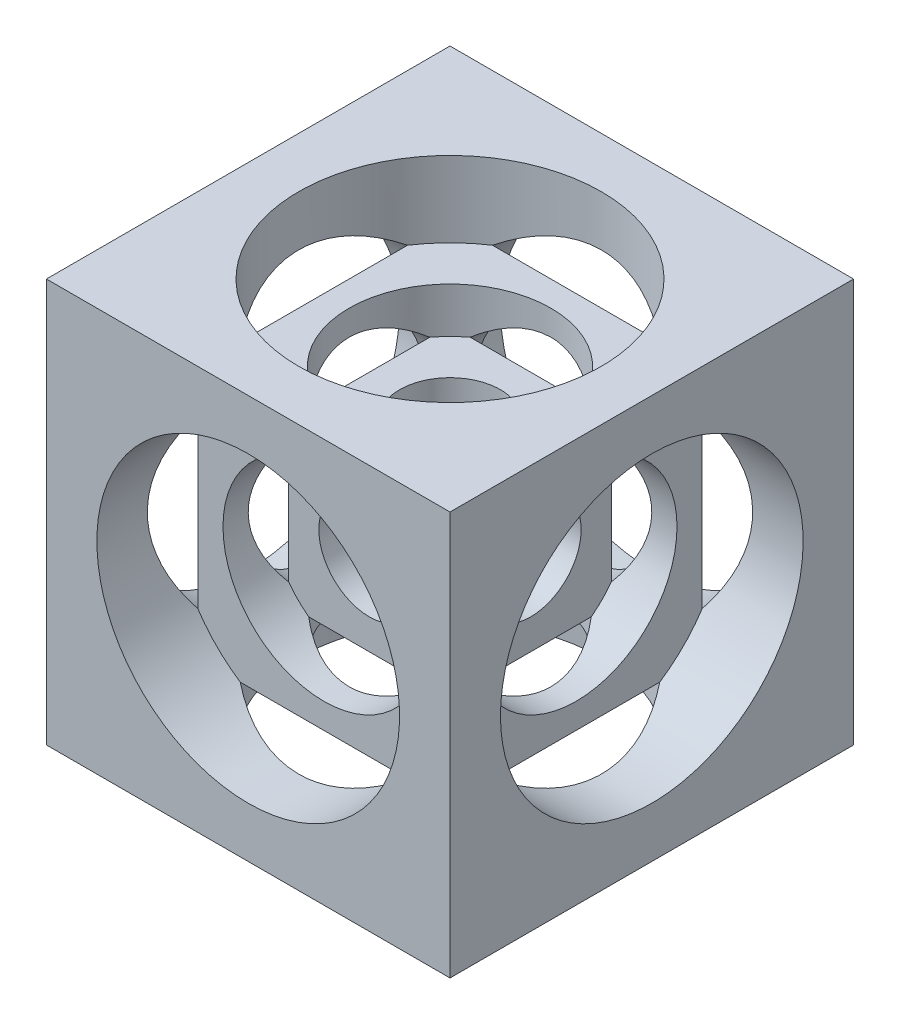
ISO-10303-21;
HEADER;
FILE_DESCRIPTION(('STEP AP214'),'2;1');
FILE_NAME('part.step','',(''),(''),'','','');
FILE_SCHEMA(('AUTOMOTIVE_DESIGN { 1 0 10303 214 1 1 1 1 }'));
ENDSEC;
DATA;
#1=APPLICATION_CONTEXT('core data for automotive mechanical design processes');
#2=APPLICATION_PROTOCOL_DEFINITION('international standard','automotive_design',2000,#1);
#3=PRODUCT_CONTEXT('',#1,'mechanical');
#4=PRODUCT('Part','Part','',(#3));
#5=PRODUCT_RELATED_PRODUCT_CATEGORY('part','',(#4));
#6=PRODUCT_DEFINITION_FORMATION('','',#4);
#7=PRODUCT_DEFINITION_CONTEXT('part definition',#1,'design');
#8=PRODUCT_DEFINITION('design','',#6,#7);
#9=PRODUCT_DEFINITION_SHAPE('','',#8);
#10=(LENGTH_UNIT() NAMED_UNIT(*) SI_UNIT(.MILLI.,.METRE.));
#11=(NAMED_UNIT(*) PLANE_ANGLE_UNIT() SI_UNIT($,.RADIAN.));
#12=(NAMED_UNIT(*) SI_UNIT($,.STERADIAN.) SOLID_ANGLE_UNIT());
#13=UNCERTAINTY_MEASURE_WITH_UNIT(LENGTH_MEASURE(1.E-05),#10,'distance_accuracy_value','');
#14=(GEOMETRIC_REPRESENTATION_CONTEXT(3) GLOBAL_UNCERTAINTY_ASSIGNED_CONTEXT((#13)) GLOBAL_UNIT_ASSIGNED_CONTEXT((#10,
#11,#12)) REPRESENTATION_CONTEXT('',''));
#15=CARTESIAN_POINT('',(0.,0.,0.));
#16=DIRECTION('',(0.,0.,1.));
#17=DIRECTION('',(1.,0.,0.));
#18=AXIS2_PLACEMENT_3D('',#15,#16,#17);
#19=CARTESIAN_POINT('',(12.7,20.6375,-12.7));
#20=DIRECTION('',(0.,1.,0.));
#21=DIRECTION('',(0.,0.,1.));
#22=AXIS2_PLACEMENT_3D('',#19,#20,#21);
#23=PLANE('',#22);
#24=CARTESIAN_POINT('',(12.7,20.6375,-12.7));
#25=DIRECTION('',(0.,1.,0.));
#26=DIRECTION('',(0.,0.,1.));
#27=AXIS2_PLACEMENT_3D('',#24,#25,#26);
#28=CIRCLE('',#27,6.35);
#29=CARTESIAN_POINT('',(12.7,20.6375,-6.35));
#30=VERTEX_POINT('',#29);
#31=EDGE_CURVE('E457',#30,#30,#28,.F.);
#32=ORIENTED_EDGE('',*,*,#31,.T.);
#33=EDGE_LOOP('',(#32));
#34=FACE_BOUND('',#33,.T.);
#35=CARTESIAN_POINT('',(12.7,20.6375,-12.7));
#36=DIRECTION('',(0.,1.,0.));
#37=DIRECTION('',(0.,0.,1.));
#38=AXIS2_PLACEMENT_3D('',#35,#36,#37);
#39=CIRCLE('',#38,9.525);
#40=CARTESIAN_POINT('',(20.6374999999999,20.6375,-17.9651418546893));
#41=VERTEX_POINT('',#40);
#42=CARTESIAN_POINT('',(17.9651418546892,20.6375,-20.6375));
#43=VERTEX_POINT('',#42);
#44=EDGE_CURVE('E377',#41,#43,#39,.T.);
#45=ORIENTED_EDGE('',*,*,#44,.T.);
#46=DIRECTION('',(-1.,0.,0.));
#47=VECTOR('',#46,1.);
#48=CARTESIAN_POINT('',(12.7,20.6375,-20.6375));
#49=LINE('',#48,#47);
#50=CARTESIAN_POINT('',(7.43485814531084,20.6375,-20.6375));
#51=VERTEX_POINT('',#50);
#52=EDGE_CURVE('E248',#43,#51,#49,.T.);
#53=ORIENTED_EDGE('',*,*,#52,.T.);
#54=CARTESIAN_POINT('',(4.76249999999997,20.6375,-17.9651418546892));
#55=VERTEX_POINT('',#54);
#56=EDGE_CURVE('E375',#51,#55,#39,.T.);
#57=ORIENTED_EDGE('',*,*,#56,.T.);
#58=DIRECTION('',(0.,0.,1.));
#59=VECTOR('',#58,1.);
#60=CARTESIAN_POINT('',(4.76249999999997,20.6375,-12.7));
#61=LINE('',#60,#59);
#62=CARTESIAN_POINT('',(4.76249999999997,20.6375,-7.43485814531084));
#63=VERTEX_POINT('',#62);
#64=EDGE_CURVE('E326',#55,#63,#61,.T.);
#65=ORIENTED_EDGE('',*,*,#64,.T.);
#66=CARTESIAN_POINT('',(7.43485814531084,20.6375,-4.76249999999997));
#67=VERTEX_POINT('',#66);
#68=EDGE_CURVE('E372',#63,#67,#39,.T.);
#69=ORIENTED_EDGE('',*,*,#68,.T.);
#70=DIRECTION('',(1.,0.,0.));
#71=VECTOR('',#70,1.);
#72=CARTESIAN_POINT('',(12.7,20.6375,-4.76249999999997));
#73=LINE('',#72,#71);
#74=CARTESIAN_POINT('',(17.9651418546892,20.6375,-4.7625));
#75=VERTEX_POINT('',#74);
#76=EDGE_CURVE('E549',#67,#75,#73,.T.);
#77=ORIENTED_EDGE('',*,*,#76,.T.);
#78=CARTESIAN_POINT('',(20.6374999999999,20.6375,-7.43485814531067));
#79=VERTEX_POINT('',#78);
#80=EDGE_CURVE('E376',#75,#79,#39,.T.);
#81=ORIENTED_EDGE('',*,*,#80,.T.);
#82=DIRECTION('',(0.,0.,-1.));
#83=VECTOR('',#82,1.);
#84=CARTESIAN_POINT('',(20.6374999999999,20.6375,-12.7));
#85=LINE('',#84,#83);
#86=EDGE_CURVE('E322',#79,#41,#85,.T.);
#87=ORIENTED_EDGE('',*,*,#86,.T.);
#88=EDGE_LOOP('',(#45,#53,#57,#65,#69,#77,#81,#87));
#89=FACE_BOUND('',#88,.T.);
#90=ADVANCED_FACE('F32',(#34,#89),#23,.T.);
#91=CARTESIAN_POINT('',(4.7625,12.7,-12.7));
#92=DIRECTION('',(-1.,0.,0.));
#93=DIRECTION('',(0.,0.,1.));
#94=AXIS2_PLACEMENT_3D('',#91,#92,#93);
#95=PLANE('',#94);
#96=CARTESIAN_POINT('',(4.7625,12.7,-12.7));
#97=DIRECTION('',(-1.,0.,0.));
#98=DIRECTION('',(0.,-1.,0.));
#99=AXIS2_PLACEMENT_3D('',#96,#97,#98);
#100=CIRCLE('',#99,6.35);
#101=CARTESIAN_POINT('',(4.76250000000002,6.34999999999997,-12.7));
#102=VERTEX_POINT('',#101);
#103=EDGE_CURVE('E324',#102,#102,#100,.F.);
#104=ORIENTED_EDGE('',*,*,#103,.T.);
#105=EDGE_LOOP('',(#104));
#106=FACE_BOUND('',#105,.T.);
#107=CARTESIAN_POINT('',(4.7625,12.7,-12.7));
#108=DIRECTION('',(-1.,0.,0.));
#109=DIRECTION('',(0.,0.,1.));
#110=AXIS2_PLACEMENT_3D('',#107,#108,#109);
#111=CIRCLE('',#110,9.525);
#112=CARTESIAN_POINT('',(4.76249999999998,17.9651418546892,-20.6375));
#113=VERTEX_POINT('',#112);
#114=EDGE_CURVE('E316',#55,#113,#111,.T.);
#115=ORIENTED_EDGE('',*,*,#114,.T.);
#116=DIRECTION('',(0.,-1.,0.));
#117=VECTOR('',#116,1.);
#118=CARTESIAN_POINT('',(4.7625,12.6999999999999,-20.6375));
#119=LINE('',#118,#117);
#120=CARTESIAN_POINT('',(4.76250000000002,7.43485814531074,-20.6375));
#121=VERTEX_POINT('',#120);
#122=EDGE_CURVE('E266',#113,#121,#119,.T.);
#123=ORIENTED_EDGE('',*,*,#122,.T.);
#124=CARTESIAN_POINT('',(4.7625,4.7625,-17.9651418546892));
#125=VERTEX_POINT('',#124);
#126=EDGE_CURVE('E315',#121,#125,#111,.T.);
#127=ORIENTED_EDGE('',*,*,#126,.T.);
#128=DIRECTION('',(0.,0.,1.));
#129=VECTOR('',#128,1.);
#130=CARTESIAN_POINT('',(4.76250000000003,4.7625,-12.7));
#131=LINE('',#130,#129);
#132=CARTESIAN_POINT('',(4.76250000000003,4.7625,-7.43485814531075));
#133=VERTEX_POINT('',#132);
#134=EDGE_CURVE('E313',#125,#133,#131,.T.);
#135=ORIENTED_EDGE('',*,*,#134,.T.);
#136=CARTESIAN_POINT('',(4.76250000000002,7.43485814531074,-4.76250000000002));
#137=VERTEX_POINT('',#136);
#138=EDGE_CURVE('E310',#133,#137,#111,.T.);
#139=ORIENTED_EDGE('',*,*,#138,.T.);
#140=DIRECTION('',(0.,1.,0.));
#141=VECTOR('',#140,1.);
#142=CARTESIAN_POINT('',(4.7625,12.6999999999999,-4.7625));
#143=LINE('',#142,#141);
#144=CARTESIAN_POINT('',(4.76249999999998,17.9651418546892,-4.76249999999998));
#145=VERTEX_POINT('',#144);
#146=EDGE_CURVE('E546',#137,#145,#143,.T.);
#147=ORIENTED_EDGE('',*,*,#146,.T.);
#148=EDGE_CURVE('E314',#145,#63,#111,.T.);
#149=ORIENTED_EDGE('',*,*,#148,.T.);
#150=ORIENTED_EDGE('',*,*,#64,.F.);
#151=EDGE_LOOP('',(#115,#123,#127,#135,#139,#147,#149,#150));
#152=FACE_BOUND('',#151,.T.);
#153=ADVANCED_FACE('F683',(#106,#152),#95,.T.);
#154=CARTESIAN_POINT('',(20.6375,12.7000000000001,-12.7));
#155=DIRECTION('',(1.,0.,0.));
#156=DIRECTION('',(0.,0.,1.));
#157=AXIS2_PLACEMENT_3D('',#154,#155,#156);
#158=PLANE('',#157);
#159=CARTESIAN_POINT('',(20.6375,12.7000000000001,-12.7));
#160=DIRECTION('',(1.,0.,0.));
#161=DIRECTION('',(0.,1.,0.));
#162=AXIS2_PLACEMENT_3D('',#159,#160,#161);
#163=CIRCLE('',#162,6.35);
#164=CARTESIAN_POINT('',(20.6374999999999,19.0500000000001,-12.7));
#165=VERTEX_POINT('',#164);
#166=EDGE_CURVE('E325',#165,#165,#163,.F.);
#167=ORIENTED_EDGE('',*,*,#166,.T.);
#168=EDGE_LOOP('',(#167));
#169=FACE_BOUND('',#168,.T.);
#170=CARTESIAN_POINT('',(20.6375,12.7000000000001,-12.7));
#171=DIRECTION('',(1.,0.,0.));
#172=DIRECTION('',(0.,0.,1.));
#173=AXIS2_PLACEMENT_3D('',#170,#171,#172);
#174=CIRCLE('',#173,9.525);
#175=CARTESIAN_POINT('',(20.6375000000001,4.7625,-17.9651418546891));
#176=VERTEX_POINT('',#175);
#177=CARTESIAN_POINT('',(20.6375000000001,7.43485814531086,-20.6375));
#178=VERTEX_POINT('',#177);
#179=EDGE_CURVE('E265',#176,#178,#174,.T.);
#180=ORIENTED_EDGE('',*,*,#179,.T.);
#181=DIRECTION('',(0.,1.,0.));
#182=VECTOR('',#181,1.);
#183=CARTESIAN_POINT('',(20.6375,12.7000000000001,-20.6375));
#184=LINE('',#183,#182);
#185=CARTESIAN_POINT('',(20.6374999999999,17.9651418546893,-20.6375));
#186=VERTEX_POINT('',#185);
#187=EDGE_CURVE('E254',#178,#186,#184,.T.);
#188=ORIENTED_EDGE('',*,*,#187,.T.);
#189=EDGE_CURVE('E262',#186,#41,#174,.T.);
#190=ORIENTED_EDGE('',*,*,#189,.T.);
#191=ORIENTED_EDGE('',*,*,#86,.F.);
#192=CARTESIAN_POINT('',(20.6374999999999,17.9651418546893,-4.76249999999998));
#193=VERTEX_POINT('',#192);
#194=EDGE_CURVE('E274',#79,#193,#174,.T.);
#195=ORIENTED_EDGE('',*,*,#194,.T.);
#196=DIRECTION('',(0.,-1.,0.));
#197=VECTOR('',#196,1.);
#198=CARTESIAN_POINT('',(20.6375,12.7000000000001,-4.7625));
#199=LINE('',#198,#197);
#200=CARTESIAN_POINT('',(20.6375000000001,7.43485814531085,-4.76250000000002));
#201=VERTEX_POINT('',#200);
#202=EDGE_CURVE('E544',#193,#201,#199,.T.);
#203=ORIENTED_EDGE('',*,*,#202,.T.);
#204=CARTESIAN_POINT('',(20.6375000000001,4.7625,-7.43485814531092));
#205=VERTEX_POINT('',#204);
#206=EDGE_CURVE('E276',#201,#205,#174,.T.);
#207=ORIENTED_EDGE('',*,*,#206,.T.);
#208=DIRECTION('',(0.,0.,1.));
#209=VECTOR('',#208,1.);
#210=CARTESIAN_POINT('',(20.6375000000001,4.7625,-12.7));
#211=LINE('',#210,#209);
#212=EDGE_CURVE('E298',#176,#205,#211,.T.);
#213=ORIENTED_EDGE('',*,*,#212,.F.);
#214=EDGE_LOOP('',(#180,#188,#190,#191,#195,#203,#207,#213));
#215=FACE_BOUND('',#214,.T.);
#216=ADVANCED_FACE('F260',(#169,#215),#158,.T.);
#217=CARTESIAN_POINT('',(12.7,4.7625,-12.7));
#218=DIRECTION('',(0.,-1.,0.));
#219=DIRECTION('',(0.,0.,1.));
#220=AXIS2_PLACEMENT_3D('',#217,#218,#219);
#221=PLANE('',#220);
#222=CARTESIAN_POINT('',(12.7,4.7625,-12.7));
#223=DIRECTION('',(0.,-1.,0.));
#224=DIRECTION('',(0.,0.,-1.));
#225=AXIS2_PLACEMENT_3D('',#222,#223,#224);
#226=CIRCLE('',#225,6.35);
#227=CARTESIAN_POINT('',(12.7,4.7625,-19.05));
#228=VERTEX_POINT('',#227);
#229=EDGE_CURVE('E321',#228,#228,#226,.F.);
#230=ORIENTED_EDGE('',*,*,#229,.T.);
#231=EDGE_LOOP('',(#230));
#232=FACE_BOUND('',#231,.T.);
#233=CARTESIAN_POINT('',(12.7,4.7625,-12.7));
#234=DIRECTION('',(0.,-1.,0.));
#235=DIRECTION('',(0.,0.,1.));
#236=AXIS2_PLACEMENT_3D('',#233,#234,#235);
#237=CIRCLE('',#236,9.525);
#238=CARTESIAN_POINT('',(7.43485814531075,4.7625,-20.6375));
#239=VERTEX_POINT('',#238);
#240=EDGE_CURVE('E301',#125,#239,#237,.T.);
#241=ORIENTED_EDGE('',*,*,#240,.T.);
#242=DIRECTION('',(1.,0.,0.));
#243=VECTOR('',#242,1.);
#244=CARTESIAN_POINT('',(12.7,4.7625,-20.6375));
#245=LINE('',#244,#243);
#246=CARTESIAN_POINT('',(17.9651418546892,4.7625,-20.6375));
#247=VERTEX_POINT('',#246);
#248=EDGE_CURVE('E267',#239,#247,#245,.T.);
#249=ORIENTED_EDGE('',*,*,#248,.T.);
#250=EDGE_CURVE('E300',#247,#176,#237,.T.);
#251=ORIENTED_EDGE('',*,*,#250,.T.);
#252=ORIENTED_EDGE('',*,*,#212,.T.);
#253=CARTESIAN_POINT('',(17.9651418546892,4.7625,-4.76250000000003));
#254=VERTEX_POINT('',#253);
#255=EDGE_CURVE('E295',#205,#254,#237,.T.);
#256=ORIENTED_EDGE('',*,*,#255,.T.);
#257=DIRECTION('',(-1.,0.,0.));
#258=VECTOR('',#257,1.);
#259=CARTESIAN_POINT('',(12.7,4.7625,-4.76250000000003));
#260=LINE('',#259,#258);
#261=CARTESIAN_POINT('',(7.43485814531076,4.7625,-4.7625));
#262=VERTEX_POINT('',#261);
#263=EDGE_CURVE('E483',#254,#262,#260,.T.);
#264=ORIENTED_EDGE('',*,*,#263,.T.);
#265=EDGE_CURVE('E299',#262,#133,#237,.T.);
#266=ORIENTED_EDGE('',*,*,#265,.T.);
#267=ORIENTED_EDGE('',*,*,#134,.F.);
#268=EDGE_LOOP('',(#241,#249,#251,#252,#256,#264,#266,#267));
#269=FACE_BOUND('',#268,.T.);
#270=ADVANCED_FACE('F738',(#232,#269),#221,.T.);
#271=CARTESIAN_POINT('',(12.7,12.7,-17.78));
#272=DIRECTION('',(0.,0.,-1.));
#273=DIRECTION('',(0.,1.,0.));
#274=AXIS2_PLACEMENT_3D('',#271,#272,#273);
#275=CYLINDRICAL_SURFACE('',#274,6.35);
#276=CARTESIAN_POINT('',(12.7,12.7,-17.78));
#277=DIRECTION('',(0.,0.,-1.));
#278=DIRECTION('',(0.,1.,0.));
#279=AXIS2_PLACEMENT_3D('',#276,#277,#278);
#280=CIRCLE('',#279,6.35);
#281=CARTESIAN_POINT('',(8.88999999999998,7.62,-17.78));
#282=VERTEX_POINT('',#281);
#283=CARTESIAN_POINT('',(7.62000000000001,8.88999999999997,-17.78));
#284=VERTEX_POINT('',#283);
#285=EDGE_CURVE('E657',#282,#284,#280,.T.);
#286=ORIENTED_EDGE('',*,*,#285,.F.);
#287=CARTESIAN_POINT('',(12.7,12.7,-12.7));
#288=DIRECTION('',(0.,-0.707106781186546,0.707106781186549));
#289=DIRECTION('',(0.,-0.707106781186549,-0.707106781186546));
#290=AXIS2_PLACEMENT_3D('',#287,#288,#289);
#291=ELLIPSE('',#290,8.98025612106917,6.35);
#292=CARTESIAN_POINT('',(16.51,7.62,-17.78));
#293=VERTEX_POINT('',#292);
#294=EDGE_CURVE('E527',#293,#282,#291,.F.);
#295=ORIENTED_EDGE('',*,*,#294,.F.);
#296=CARTESIAN_POINT('',(17.78,8.89000000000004,-17.78));
#297=VERTEX_POINT('',#296);
#298=EDGE_CURVE('E512',#297,#293,#280,.T.);
#299=ORIENTED_EDGE('',*,*,#298,.F.);
#300=CARTESIAN_POINT('',(12.7,12.7,-12.7));
#301=DIRECTION('',(0.707106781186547,0.,0.707106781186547));
#302=DIRECTION('',(0.707106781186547,0.,-0.707106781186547));
#303=AXIS2_PLACEMENT_3D('',#300,#301,#302);
#304=ELLIPSE('',#303,8.98025612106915,6.35);
#305=CARTESIAN_POINT('',(17.78,16.51,-17.78));
#306=VERTEX_POINT('',#305);
#307=EDGE_CURVE('E530',#306,#297,#304,.F.);
#308=ORIENTED_EDGE('',*,*,#307,.F.);
#309=CARTESIAN_POINT('',(16.51,17.78,-17.78));
#310=VERTEX_POINT('',#309);
#311=EDGE_CURVE('E490',#310,#306,#280,.T.);
#312=ORIENTED_EDGE('',*,*,#311,.F.);
#313=CARTESIAN_POINT('',(12.7,12.7,-12.7));
#314=DIRECTION('',(0.,0.707106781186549,0.707106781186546));
#315=DIRECTION('',(0.,0.707106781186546,-0.707106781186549));
#316=AXIS2_PLACEMENT_3D('',#313,#314,#315);
#317=ELLIPSE('',#316,8.98025612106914,6.35);
#318=CARTESIAN_POINT('',(8.89000000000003,17.78,-17.78));
#319=VERTEX_POINT('',#318);
#320=EDGE_CURVE('E524',#319,#310,#317,.F.);
#321=ORIENTED_EDGE('',*,*,#320,.F.);
#322=CARTESIAN_POINT('',(7.61999999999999,16.51,-17.78));
#323=VERTEX_POINT('',#322);
#324=EDGE_CURVE('E509',#323,#319,#280,.T.);
#325=ORIENTED_EDGE('',*,*,#324,.F.);
#326=CARTESIAN_POINT('',(12.7,12.7,-12.7));
#327=DIRECTION('',(-0.707106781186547,0.,0.707106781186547));
#328=DIRECTION('',(-0.707106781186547,0.,-0.707106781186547));
#329=AXIS2_PLACEMENT_3D('',#326,#327,#328);
#330=ELLIPSE('',#329,8.98025612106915,6.35);
#331=EDGE_CURVE('E533',#284,#323,#330,.F.);
#332=ORIENTED_EDGE('',*,*,#331,.F.);
#333=EDGE_LOOP('',(#286,#295,#299,#308,#312,#321,#325,#332));
#334=FACE_BOUND('',#333,.T.);
#335=CARTESIAN_POINT('',(12.7,12.7,-20.6375));
#336=DIRECTION('',(0.,0.,-1.));
#337=DIRECTION('',(0.,1.,0.));
#338=AXIS2_PLACEMENT_3D('',#335,#336,#337);
#339=CIRCLE('',#338,6.35);
#340=CARTESIAN_POINT('',(12.7,19.05,-20.6375));
#341=VERTEX_POINT('',#340);
#342=EDGE_CURVE('E257',#341,#341,#339,.F.);
#343=ORIENTED_EDGE('',*,*,#342,.F.);
#344=EDGE_LOOP('',(#343));
#345=FACE_BOUND('',#344,.T.);
#346=ADVANCED_FACE('F651',(#334,#345),#275,.F.);
#347=CARTESIAN_POINT('',(12.7,17.78,-12.7));
#348=DIRECTION('',(0.,1.,0.));
#349=DIRECTION('',(0.,0.,1.));
#350=AXIS2_PLACEMENT_3D('',#347,#348,#349);
#351=PLANE('',#350);
#352=CARTESIAN_POINT('',(12.7,17.78,-12.7));
#353=DIRECTION('',(0.,1.,0.));
#354=DIRECTION('',(0.,0.,1.));
#355=AXIS2_PLACEMENT_3D('',#352,#353,#354);
#356=CIRCLE('',#355,3.175);
#357=CARTESIAN_POINT('',(12.7,17.78,-9.525));
#358=VERTEX_POINT('',#357);
#359=EDGE_CURVE('E391',#358,#358,#356,.F.);
#360=ORIENTED_EDGE('',*,*,#359,.T.);
#361=EDGE_LOOP('',(#360));
#362=FACE_BOUND('',#361,.T.);
#363=CARTESIAN_POINT('',(12.7,17.78,-12.7));
#364=DIRECTION('',(0.,1.,0.));
#365=DIRECTION('',(0.,0.,1.));
#366=AXIS2_PLACEMENT_3D('',#363,#364,#365);
#367=CIRCLE('',#366,6.35);
#368=CARTESIAN_POINT('',(17.7799999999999,17.7800000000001,-16.5100000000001));
#369=VERTEX_POINT('',#368);
#370=EDGE_CURVE('E386',#369,#310,#367,.T.);
#371=ORIENTED_EDGE('',*,*,#370,.T.);
#372=DIRECTION('',(-1.,0.,0.));
#373=VECTOR('',#372,1.);
#374=CARTESIAN_POINT('',(12.7,17.78,-17.78));
#375=LINE('',#374,#373);
#376=EDGE_CURVE('E521',#310,#319,#375,.T.);
#377=ORIENTED_EDGE('',*,*,#376,.T.);
#378=CARTESIAN_POINT('',(7.61999999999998,17.78,-16.51));
#379=VERTEX_POINT('',#378);
#380=EDGE_CURVE('E384',#319,#379,#367,.T.);
#381=ORIENTED_EDGE('',*,*,#380,.T.);
#382=DIRECTION('',(0.,0.,1.));
#383=VECTOR('',#382,1.);
#384=CARTESIAN_POINT('',(7.61999999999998,17.78,-12.7));
#385=LINE('',#384,#383);
#386=CARTESIAN_POINT('',(7.61999999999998,17.78,-8.89000000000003));
#387=VERTEX_POINT('',#386);
#388=EDGE_CURVE('E462',#379,#387,#385,.T.);
#389=ORIENTED_EDGE('',*,*,#388,.T.);
#390=CARTESIAN_POINT('',(8.89000000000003,17.78,-7.61999999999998));
#391=VERTEX_POINT('',#390);
#392=EDGE_CURVE('E381',#387,#391,#367,.T.);
#393=ORIENTED_EDGE('',*,*,#392,.T.);
#394=DIRECTION('',(1.,0.,0.));
#395=VECTOR('',#394,1.);
#396=CARTESIAN_POINT('',(12.7,17.78,-7.61999999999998));
#397=LINE('',#396,#395);
#398=CARTESIAN_POINT('',(16.51,17.78,-7.62));
#399=VERTEX_POINT('',#398);
#400=EDGE_CURVE('E574',#391,#399,#397,.T.);
#401=ORIENTED_EDGE('',*,*,#400,.T.);
#402=CARTESIAN_POINT('',(17.7799999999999,17.78,-8.88999999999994));
#403=VERTEX_POINT('',#402);
#404=EDGE_CURVE('E385',#399,#403,#367,.T.);
#405=ORIENTED_EDGE('',*,*,#404,.T.);
#406=DIRECTION('',(0.,0.,-1.));
#407=VECTOR('',#406,1.);
#408=CARTESIAN_POINT('',(17.7799999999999,17.78,-12.7));
#409=LINE('',#408,#407);
#410=EDGE_CURVE('E454',#403,#369,#409,.T.);
#411=ORIENTED_EDGE('',*,*,#410,.T.);
#412=EDGE_LOOP('',(#371,#377,#381,#389,#393,#401,#405,#411));
#413=FACE_BOUND('',#412,.T.);
#414=ADVANCED_FACE('F635',(#362,#413),#351,.T.);
#415=CARTESIAN_POINT('',(12.7,7.62,-12.7));
#416=DIRECTION('',(0.,-1.,0.));
#417=DIRECTION('',(0.,0.,1.));
#418=AXIS2_PLACEMENT_3D('',#415,#416,#417);
#419=PLANE('',#418);
#420=CARTESIAN_POINT('',(12.7,7.62,-12.7));
#421=DIRECTION('',(0.,-1.,0.));
#422=DIRECTION('',(0.,0.,-1.));
#423=AXIS2_PLACEMENT_3D('',#420,#421,#422);
#424=CIRCLE('',#423,3.175);
#425=CARTESIAN_POINT('',(12.7,7.62,-15.875));
#426=VERTEX_POINT('',#425);
#427=EDGE_CURVE('E371',#426,#426,#424,.F.);
#428=ORIENTED_EDGE('',*,*,#427,.T.);
#429=EDGE_LOOP('',(#428));
#430=FACE_BOUND('',#429,.T.);
#431=CARTESIAN_POINT('',(12.7,7.62,-12.7));
#432=DIRECTION('',(0.,-1.,0.));
#433=DIRECTION('',(0.,0.,1.));
#434=AXIS2_PLACEMENT_3D('',#431,#432,#433);
#435=CIRCLE('',#434,6.35);
#436=CARTESIAN_POINT('',(7.62,7.62,-16.51));
#437=VERTEX_POINT('',#436);
#438=EDGE_CURVE('E344',#437,#282,#435,.T.);
#439=ORIENTED_EDGE('',*,*,#438,.T.);
#440=DIRECTION('',(1.,0.,0.));
#441=VECTOR('',#440,1.);
#442=CARTESIAN_POINT('',(12.7,7.62,-17.78));
#443=LINE('',#442,#441);
#444=EDGE_CURVE('E518',#282,#293,#443,.T.);
#445=ORIENTED_EDGE('',*,*,#444,.T.);
#446=CARTESIAN_POINT('',(17.7800000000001,7.62,-16.5099999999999));
#447=VERTEX_POINT('',#446);
#448=EDGE_CURVE('E338',#293,#447,#435,.T.);
#449=ORIENTED_EDGE('',*,*,#448,.T.);
#450=DIRECTION('',(0.,0.,1.));
#451=VECTOR('',#450,1.);
#452=CARTESIAN_POINT('',(17.7800000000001,7.62,-12.7));
#453=LINE('',#452,#451);
#454=CARTESIAN_POINT('',(17.7800000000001,7.62,-8.89000000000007));
#455=VERTEX_POINT('',#454);
#456=EDGE_CURVE('E342',#447,#455,#453,.T.);
#457=ORIENTED_EDGE('',*,*,#456,.T.);
#458=CARTESIAN_POINT('',(16.51,7.62,-7.62000000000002));
#459=VERTEX_POINT('',#458);
#460=EDGE_CURVE('E339',#455,#459,#435,.T.);
#461=ORIENTED_EDGE('',*,*,#460,.T.);
#462=DIRECTION('',(-1.,0.,0.));
#463=VECTOR('',#462,1.);
#464=CARTESIAN_POINT('',(12.7,7.62,-7.62000000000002));
#465=LINE('',#464,#463);
#466=CARTESIAN_POINT('',(8.88999999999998,7.62,-7.62000000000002));
#467=VERTEX_POINT('',#466);
#468=EDGE_CURVE('E568',#459,#467,#465,.T.);
#469=ORIENTED_EDGE('',*,*,#468,.T.);
#470=CARTESIAN_POINT('',(7.62000000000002,7.62,-8.88999999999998));
#471=VERTEX_POINT('',#470);
#472=EDGE_CURVE('E343',#467,#471,#435,.T.);
#473=ORIENTED_EDGE('',*,*,#472,.T.);
#474=DIRECTION('',(0.,0.,1.));
#475=VECTOR('',#474,1.);
#476=CARTESIAN_POINT('',(7.62000000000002,7.62,-12.7));
#477=LINE('',#476,#475);
#478=EDGE_CURVE('E354',#437,#471,#477,.T.);
#479=ORIENTED_EDGE('',*,*,#478,.F.);
#480=EDGE_LOOP('',(#439,#445,#449,#457,#461,#469,#473,#479));
#481=FACE_BOUND('',#480,.T.);
#482=ADVANCED_FACE('F611',(#430,#481),#419,.T.);
#483=CARTESIAN_POINT('',(7.62,12.7,-12.7));
#484=DIRECTION('',(-1.,0.,0.));
#485=DIRECTION('',(0.,0.,1.));
#486=AXIS2_PLACEMENT_3D('',#483,#484,#485);
#487=PLANE('',#486);
#488=CARTESIAN_POINT('',(7.62,12.7,-12.7));
#489=DIRECTION('',(-1.,0.,0.));
#490=DIRECTION('',(0.,-1.,0.));
#491=AXIS2_PLACEMENT_3D('',#488,#489,#490);
#492=CIRCLE('',#491,3.175);
#493=CARTESIAN_POINT('',(7.62000000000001,9.525,-12.7));
#494=VERTEX_POINT('',#493);
#495=EDGE_CURVE('E368',#494,#494,#492,.F.);
#496=ORIENTED_EDGE('',*,*,#495,.T.);
#497=EDGE_LOOP('',(#496));
#498=FACE_BOUND('',#497,.T.);
#499=CARTESIAN_POINT('',(7.62,12.7,-12.7));
#500=DIRECTION('',(-1.,0.,0.));
#501=DIRECTION('',(0.,0.,1.));
#502=AXIS2_PLACEMENT_3D('',#499,#500,#501);
#503=CIRCLE('',#502,6.35);
#504=EDGE_CURVE('E356',#379,#323,#503,.T.);
#505=ORIENTED_EDGE('',*,*,#504,.T.);
#506=DIRECTION('',(0.,-1.,0.));
#507=VECTOR('',#506,1.);
#508=CARTESIAN_POINT('',(7.62,12.7,-17.78));
#509=LINE('',#508,#507);
#510=EDGE_CURVE('E515',#323,#284,#509,.T.);
#511=ORIENTED_EDGE('',*,*,#510,.T.);
#512=EDGE_CURVE('E350',#284,#437,#503,.T.);
#513=ORIENTED_EDGE('',*,*,#512,.T.);
#514=ORIENTED_EDGE('',*,*,#478,.T.);
#515=CARTESIAN_POINT('',(7.62000000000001,8.88999999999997,-7.62000000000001));
#516=VERTEX_POINT('',#515);
#517=EDGE_CURVE('E351',#471,#516,#503,.T.);
#518=ORIENTED_EDGE('',*,*,#517,.T.);
#519=DIRECTION('',(0.,1.,0.));
#520=VECTOR('',#519,1.);
#521=CARTESIAN_POINT('',(7.62,12.7,-7.62));
#522=LINE('',#521,#520);
#523=CARTESIAN_POINT('',(7.61999999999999,16.51,-7.61999999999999));
#524=VERTEX_POINT('',#523);
#525=EDGE_CURVE('E564',#516,#524,#522,.T.);
#526=ORIENTED_EDGE('',*,*,#525,.T.);
#527=EDGE_CURVE('E355',#524,#387,#503,.T.);
#528=ORIENTED_EDGE('',*,*,#527,.T.);
#529=ORIENTED_EDGE('',*,*,#388,.F.);
#530=EDGE_LOOP('',(#505,#511,#513,#514,#518,#526,#528,#529));
#531=FACE_BOUND('',#530,.T.);
#532=ADVANCED_FACE('F625',(#498,#531),#487,.T.);
#533=CARTESIAN_POINT('',(17.78,12.7000000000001,-12.7));
#534=DIRECTION('',(1.,0.,0.));
#535=DIRECTION('',(0.,0.,1.));
#536=AXIS2_PLACEMENT_3D('',#533,#534,#535);
#537=PLANE('',#536);
#538=CARTESIAN_POINT('',(17.78,12.7,-12.7));
#539=DIRECTION('',(1.,0.,0.));
#540=DIRECTION('',(0.,1.,0.));
#541=AXIS2_PLACEMENT_3D('',#538,#539,#540);
#542=CIRCLE('',#541,3.175);
#543=CARTESIAN_POINT('',(17.78,15.875,-12.7));
#544=VERTEX_POINT('',#543);
#545=EDGE_CURVE('E362',#544,#544,#542,.F.);
#546=ORIENTED_EDGE('',*,*,#545,.T.);
#547=EDGE_LOOP('',(#546));
#548=FACE_BOUND('',#547,.T.);
#549=CARTESIAN_POINT('',(17.78,12.7000000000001,-12.7));
#550=DIRECTION('',(1.,0.,0.));
#551=DIRECTION('',(0.,0.,1.));
#552=AXIS2_PLACEMENT_3D('',#549,#550,#551);
#553=CIRCLE('',#552,6.35);
#554=EDGE_CURVE('E330',#447,#297,#553,.T.);
#555=ORIENTED_EDGE('',*,*,#554,.T.);
#556=DIRECTION('',(0.,1.,0.));
#557=VECTOR('',#556,1.);
#558=CARTESIAN_POINT('',(17.78,12.7,-17.78));
#559=LINE('',#558,#557);
#560=EDGE_CURVE('E489',#297,#306,#559,.T.);
#561=ORIENTED_EDGE('',*,*,#560,.T.);
#562=EDGE_CURVE('E334',#306,#369,#553,.T.);
#563=ORIENTED_EDGE('',*,*,#562,.T.);
#564=ORIENTED_EDGE('',*,*,#410,.F.);
#565=CARTESIAN_POINT('',(17.78,16.51,-7.61999999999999));
#566=VERTEX_POINT('',#565);
#567=EDGE_CURVE('E335',#403,#566,#553,.T.);
#568=ORIENTED_EDGE('',*,*,#567,.T.);
#569=DIRECTION('',(0.,-1.,0.));
#570=VECTOR('',#569,1.);
#571=CARTESIAN_POINT('',(17.78,12.7,-7.62));
#572=LINE('',#571,#570);
#573=CARTESIAN_POINT('',(17.78,8.89000000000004,-7.62000000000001));
#574=VERTEX_POINT('',#573);
#575=EDGE_CURVE('E477',#566,#574,#572,.T.);
#576=ORIENTED_EDGE('',*,*,#575,.T.);
#577=EDGE_CURVE('E329',#574,#455,#553,.T.);
#578=ORIENTED_EDGE('',*,*,#577,.T.);
#579=ORIENTED_EDGE('',*,*,#456,.F.);
#580=EDGE_LOOP('',(#555,#561,#563,#564,#568,#576,#578,#579));
#581=FACE_BOUND('',#580,.T.);
#582=ADVANCED_FACE('F599',(#548,#581),#537,.T.);
#583=CARTESIAN_POINT('',(12.7,12.7,-25.4));
#584=DIRECTION('',(0.,0.,1.));
#585=DIRECTION('',(1.,0.,0.));
#586=AXIS2_PLACEMENT_3D('',#583,#584,#585);
#587=CYLINDRICAL_SURFACE('',#586,3.175);
#588=CARTESIAN_POINT('',(12.7,12.7,-12.7));
#589=DIRECTION('',(0.,0.707106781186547,-0.707106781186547));
#590=DIRECTION('',(0.,0.707106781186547,0.707106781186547));
#591=AXIS2_PLACEMENT_3D('',#588,#589,#590);
#592=ELLIPSE('',#591,4.49012806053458,3.175);
#593=CARTESIAN_POINT('',(14.9450640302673,10.4549359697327,-14.9450640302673));
#594=VERTEX_POINT('',#593);
#595=CARTESIAN_POINT('',(10.4549359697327,10.4549359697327,-14.9450640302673));
#596=VERTEX_POINT('',#595);
#597=EDGE_CURVE('E439',#594,#596,#592,.T.);
#598=ORIENTED_EDGE('',*,*,#597,.F.);
#599=CARTESIAN_POINT('',(12.7,12.7,-12.7));
#600=DIRECTION('',(0.707106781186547,0.,0.707106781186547));
#601=DIRECTION('',(-0.707106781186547,0.,0.707106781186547));
#602=AXIS2_PLACEMENT_3D('',#599,#600,#601);
#603=ELLIPSE('',#602,4.49012806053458,3.175);
#604=CARTESIAN_POINT('',(14.9450640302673,14.9450640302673,-14.9450640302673));
#605=VERTEX_POINT('',#604);
#606=EDGE_CURVE('E451',#594,#605,#603,.T.);
#607=ORIENTED_EDGE('',*,*,#606,.T.);
#608=CARTESIAN_POINT('',(12.7,12.7,-12.7));
#609=DIRECTION('',(0.,0.707106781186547,0.707106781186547));
#610=DIRECTION('',(0.,0.707106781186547,-0.707106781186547));
#611=AXIS2_PLACEMENT_3D('',#608,#609,#610);
#612=ELLIPSE('',#611,4.49012806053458,3.175);
#613=CARTESIAN_POINT('',(10.4549359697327,14.9450640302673,-14.9450640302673));
#614=VERTEX_POINT('',#613);
#615=EDGE_CURVE('E445',#614,#605,#612,.F.);
#616=ORIENTED_EDGE('',*,*,#615,.F.);
#617=CARTESIAN_POINT('',(12.7,12.7,-12.7));
#618=DIRECTION('',(-0.707106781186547,0.,0.707106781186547));
#619=DIRECTION('',(0.707106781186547,0.,0.707106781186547));
#620=AXIS2_PLACEMENT_3D('',#617,#618,#619);
#621=ELLIPSE('',#620,4.49012806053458,3.175);
#622=EDGE_CURVE('E448',#614,#596,#621,.T.);
#623=ORIENTED_EDGE('',*,*,#622,.T.);
#624=EDGE_LOOP('',(#598,#607,#616,#623));
#625=FACE_BOUND('',#624,.T.);
#626=CARTESIAN_POINT('',(12.7,12.7,-17.78));
#627=DIRECTION('',(0.,0.,-1.));
#628=DIRECTION('',(0.,1.,0.));
#629=AXIS2_PLACEMENT_3D('',#626,#627,#628);
#630=CIRCLE('',#629,3.175);
#631=CARTESIAN_POINT('',(12.7,15.875,-17.78));
#632=VERTEX_POINT('',#631);
#633=EDGE_CURVE('E487',#632,#632,#630,.F.);
#634=ORIENTED_EDGE('',*,*,#633,.F.);
#635=EDGE_LOOP('',(#634));
#636=FACE_BOUND('',#635,.T.);
#637=ADVANCED_FACE('F665',(#625,#636),#587,.F.);
#638=CARTESIAN_POINT('',(12.7,12.7,-7.62));
#639=DIRECTION('',(0.,0.,1.));
#640=DIRECTION('',(0.,-1.,0.));
#641=AXIS2_PLACEMENT_3D('',#638,#639,#640);
#642=CYLINDRICAL_SURFACE('',#641,6.35);
#643=CARTESIAN_POINT('',(12.7,12.7,-7.62));
#644=DIRECTION('',(0.,0.,1.));
#645=DIRECTION('',(0.,-1.,0.));
#646=AXIS2_PLACEMENT_3D('',#643,#644,#645);
#647=CIRCLE('',#646,6.35);
#648=EDGE_CURVE('E642',#391,#524,#647,.T.);
#649=ORIENTED_EDGE('',*,*,#648,.F.);
#650=CARTESIAN_POINT('',(12.7,12.7,-12.7));
#651=DIRECTION('',(0.,0.707106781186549,-0.707106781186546));
#652=DIRECTION('',(0.,0.707106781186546,0.707106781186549));
#653=AXIS2_PLACEMENT_3D('',#650,#651,#652);
#654=ELLIPSE('',#653,8.98025612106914,6.35);
#655=EDGE_CURVE('E577',#399,#391,#654,.F.);
#656=ORIENTED_EDGE('',*,*,#655,.F.);
#657=EDGE_CURVE('E565',#566,#399,#647,.T.);
#658=ORIENTED_EDGE('',*,*,#657,.F.);
#659=CARTESIAN_POINT('',(12.7,12.7,-12.7));
#660=DIRECTION('',(0.707106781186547,0.,-0.707106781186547));
#661=DIRECTION('',(0.707106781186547,0.,0.707106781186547));
#662=AXIS2_PLACEMENT_3D('',#659,#660,#661);
#663=ELLIPSE('',#662,8.98025612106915,6.35);
#664=EDGE_CURVE('E290',#574,#566,#663,.F.);
#665=ORIENTED_EDGE('',*,*,#664,.F.);
#666=EDGE_CURVE('E562',#459,#574,#647,.T.);
#667=ORIENTED_EDGE('',*,*,#666,.F.);
#668=CARTESIAN_POINT('',(12.7,12.7,-12.7));
#669=DIRECTION('',(0.,-0.707106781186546,-0.707106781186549));
#670=DIRECTION('',(0.,-0.707106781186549,0.707106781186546));
#671=AXIS2_PLACEMENT_3D('',#668,#669,#670);
#672=ELLIPSE('',#671,8.98025612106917,6.35);
#673=EDGE_CURVE('E580',#467,#459,#672,.F.);
#674=ORIENTED_EDGE('',*,*,#673,.F.);
#675=EDGE_CURVE('E561',#516,#467,#647,.T.);
#676=ORIENTED_EDGE('',*,*,#675,.F.);
#677=CARTESIAN_POINT('',(12.7,12.7,-12.7));
#678=DIRECTION('',(-0.707106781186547,0.,-0.707106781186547));
#679=DIRECTION('',(-0.707106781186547,0.,0.707106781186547));
#680=AXIS2_PLACEMENT_3D('',#677,#678,#679);
#681=ELLIPSE('',#680,8.98025612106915,6.35);
#682=EDGE_CURVE('E286',#524,#516,#681,.F.);
#683=ORIENTED_EDGE('',*,*,#682,.F.);
#684=EDGE_LOOP('',(#649,#656,#658,#665,#667,#674,#676,#683));
#685=FACE_BOUND('',#684,.T.);
#686=CARTESIAN_POINT('',(12.7,12.7,-4.7625));
#687=DIRECTION('',(0.,0.,1.));
#688=DIRECTION('',(0.,-1.,0.));
#689=AXIS2_PLACEMENT_3D('',#686,#687,#688);
#690=CIRCLE('',#689,6.35);
#691=CARTESIAN_POINT('',(12.7,6.34999999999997,-4.76250000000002));
#692=VERTEX_POINT('',#691);
#693=EDGE_CURVE('E480',#692,#692,#690,.F.);
#694=ORIENTED_EDGE('',*,*,#693,.F.);
#695=EDGE_LOOP('',(#694));
#696=FACE_BOUND('',#695,.T.);
#697=ADVANCED_FACE('F640',(#685,#696),#642,.F.);
#698=CARTESIAN_POINT('',(12.7,12.7,-12.7));
#699=DIRECTION('',(0.,0.707106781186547,0.707106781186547));
#700=DIRECTION('',(0.,0.707106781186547,-0.707106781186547));
#701=AXIS2_PLACEMENT_3D('',#698,#699,#700);
#702=ELLIPSE('',#701,4.49012806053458,3.175);
#703=CARTESIAN_POINT('',(10.4549359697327,10.4549359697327,-10.4549359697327));
#704=VERTEX_POINT('',#703);
#705=CARTESIAN_POINT('',(14.9450640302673,10.4549359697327,-10.4549359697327));
#706=VERTEX_POINT('',#705);
#707=EDGE_CURVE('E442',#704,#706,#702,.T.);
#708=ORIENTED_EDGE('',*,*,#707,.F.);
#709=CARTESIAN_POINT('',(12.7,12.7,-12.7));
#710=DIRECTION('',(0.707106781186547,0.,0.707106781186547));
#711=DIRECTION('',(-0.707106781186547,0.,0.707106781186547));
#712=AXIS2_PLACEMENT_3D('',#709,#710,#711);
#713=ELLIPSE('',#712,4.49012806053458,3.175);
#714=CARTESIAN_POINT('',(10.4549359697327,14.9450640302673,-10.4549359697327));
#715=VERTEX_POINT('',#714);
#716=EDGE_CURVE('E394',#704,#715,#713,.F.);
#717=ORIENTED_EDGE('',*,*,#716,.T.);
#718=CARTESIAN_POINT('',(12.7,12.7,-12.7));
#719=DIRECTION('',(0.,0.707106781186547,-0.707106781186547));
#720=DIRECTION('',(0.,0.707106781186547,0.707106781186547));
#721=AXIS2_PLACEMENT_3D('',#718,#719,#720);
#722=ELLIPSE('',#721,4.49012806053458,3.175);
#723=CARTESIAN_POINT('',(14.9450640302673,14.9450640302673,-10.4549359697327));
#724=VERTEX_POINT('',#723);
#725=EDGE_CURVE('E436',#724,#715,#722,.F.);
#726=ORIENTED_EDGE('',*,*,#725,.F.);
#727=CARTESIAN_POINT('',(12.7,12.7,-12.7));
#728=DIRECTION('',(-0.707106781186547,0.,0.707106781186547));
#729=DIRECTION('',(0.707106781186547,0.,0.707106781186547));
#730=AXIS2_PLACEMENT_3D('',#727,#728,#729);
#731=ELLIPSE('',#730,4.49012806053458,3.175);
#732=EDGE_CURVE('E403',#724,#706,#731,.F.);
#733=ORIENTED_EDGE('',*,*,#732,.T.);
#734=EDGE_LOOP('',(#708,#717,#726,#733));
#735=FACE_BOUND('',#734,.T.);
#736=CARTESIAN_POINT('',(12.7,12.7,-7.62));
#737=DIRECTION('',(0.,0.,1.));
#738=DIRECTION('',(0.,-1.,0.));
#739=AXIS2_PLACEMENT_3D('',#736,#737,#738);
#740=CIRCLE('',#739,3.175);
#741=CARTESIAN_POINT('',(12.7,9.525,-7.62000000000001));
#742=VERTEX_POINT('',#741);
#743=EDGE_CURVE('E571',#742,#742,#740,.F.);
#744=ORIENTED_EDGE('',*,*,#743,.F.);
#745=EDGE_LOOP('',(#744));
#746=FACE_BOUND('',#745,.T.);
#747=ADVANCED_FACE('F669',(#735,#746),#587,.F.);
#748=CARTESIAN_POINT('',(7.62,12.7,-12.7));
#749=DIRECTION('',(-1.,0.,0.));
#750=DIRECTION('',(0.,-1.,0.));
#751=AXIS2_PLACEMENT_3D('',#748,#749,#750);
#752=CYLINDRICAL_SURFACE('',#751,6.35);
#753=ORIENTED_EDGE('',*,*,#512,.F.);
#754=ORIENTED_EDGE('',*,*,#331,.T.);
#755=ORIENTED_EDGE('',*,*,#504,.F.);
#756=CARTESIAN_POINT('',(12.7,12.7,-12.7));
#757=DIRECTION('',(0.707106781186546,0.707106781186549,0.));
#758=DIRECTION('',(-0.707106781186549,0.707106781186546,0.));
#759=AXIS2_PLACEMENT_3D('',#756,#757,#758);
#760=ELLIPSE('',#759,8.98025612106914,6.35);
#761=EDGE_CURVE('E365',#387,#379,#760,.F.);
#762=ORIENTED_EDGE('',*,*,#761,.F.);
#763=ORIENTED_EDGE('',*,*,#527,.F.);
#764=ORIENTED_EDGE('',*,*,#682,.T.);
#765=ORIENTED_EDGE('',*,*,#517,.F.);
#766=CARTESIAN_POINT('',(12.7,12.7,-12.7));
#767=DIRECTION('',(-0.707106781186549,0.707106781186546,0.));
#768=DIRECTION('',(-0.707106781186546,-0.707106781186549,0.));
#769=AXIS2_PLACEMENT_3D('',#766,#767,#768);
#770=ELLIPSE('',#769,8.98025612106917,6.35);
#771=EDGE_CURVE('E347',#471,#437,#770,.F.);
#772=ORIENTED_EDGE('',*,*,#771,.T.);
#773=EDGE_LOOP('',(#753,#754,#755,#762,#763,#764,#765,#772));
#774=FACE_BOUND('',#773,.T.);
#775=ORIENTED_EDGE('',*,*,#103,.F.);
#776=EDGE_LOOP('',(#775));
#777=FACE_BOUND('',#776,.T.);
#778=ADVANCED_FACE('F618',(#774,#777),#752,.F.);
#779=CARTESIAN_POINT('',(17.78,12.7000000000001,-12.7));
#780=DIRECTION('',(1.,0.,0.));
#781=DIRECTION('',(0.,1.,0.));
#782=AXIS2_PLACEMENT_3D('',#779,#780,#781);
#783=CYLINDRICAL_SURFACE('',#782,6.35);
#784=ORIENTED_EDGE('',*,*,#562,.F.);
#785=ORIENTED_EDGE('',*,*,#307,.T.);
#786=ORIENTED_EDGE('',*,*,#554,.F.);
#787=CARTESIAN_POINT('',(12.7,12.7,-12.7));
#788=DIRECTION('',(-0.707106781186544,-0.707106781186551,0.));
#789=DIRECTION('',(0.707106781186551,-0.707106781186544,0.));
#790=AXIS2_PLACEMENT_3D('',#787,#788,#789);
#791=ELLIPSE('',#790,8.98025612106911,6.35);
#792=EDGE_CURVE('E333',#455,#447,#791,.F.);
#793=ORIENTED_EDGE('',*,*,#792,.F.);
#794=ORIENTED_EDGE('',*,*,#577,.F.);
#795=ORIENTED_EDGE('',*,*,#664,.T.);
#796=ORIENTED_EDGE('',*,*,#567,.F.);
#797=CARTESIAN_POINT('',(12.7,12.7,-12.7));
#798=DIRECTION('',(-0.707106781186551,0.707106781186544,0.));
#799=DIRECTION('',(0.707106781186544,0.707106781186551,0.));
#800=AXIS2_PLACEMENT_3D('',#797,#798,#799);
#801=ELLIPSE('',#800,8.9802561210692,6.35);
#802=EDGE_CURVE('E359',#369,#403,#801,.F.);
#803=ORIENTED_EDGE('',*,*,#802,.F.);
#804=EDGE_LOOP('',(#784,#785,#786,#793,#794,#795,#796,#803));
#805=FACE_BOUND('',#804,.T.);
#806=ORIENTED_EDGE('',*,*,#166,.F.);
#807=EDGE_LOOP('',(#806));
#808=FACE_BOUND('',#807,.T.);
#809=ADVANCED_FACE('F590',(#805,#808),#783,.F.);
#810=CARTESIAN_POINT('',(12.7,7.62,-12.7));
#811=DIRECTION('',(0.,-1.,0.));
#812=DIRECTION('',(0.,0.,-1.));
#813=AXIS2_PLACEMENT_3D('',#810,#811,#812);
#814=CYLINDRICAL_SURFACE('',#813,6.35);
#815=ORIENTED_EDGE('',*,*,#448,.F.);
#816=ORIENTED_EDGE('',*,*,#294,.T.);
#817=ORIENTED_EDGE('',*,*,#438,.F.);
#818=ORIENTED_EDGE('',*,*,#771,.F.);
#819=ORIENTED_EDGE('',*,*,#472,.F.);
#820=ORIENTED_EDGE('',*,*,#673,.T.);
#821=ORIENTED_EDGE('',*,*,#460,.F.);
#822=ORIENTED_EDGE('',*,*,#792,.T.);
#823=EDGE_LOOP('',(#815,#816,#817,#818,#819,#820,#821,#822));
#824=FACE_BOUND('',#823,.T.);
#825=ORIENTED_EDGE('',*,*,#229,.F.);
#826=EDGE_LOOP('',(#825));
#827=FACE_BOUND('',#826,.T.);
#828=ADVANCED_FACE('F604',(#824,#827),#814,.F.);
#829=CARTESIAN_POINT('',(12.7,0.,-12.7));
#830=DIRECTION('',(0.,1.,0.));
#831=DIRECTION('',(0.,0.,1.));
#832=AXIS2_PLACEMENT_3D('',#829,#830,#831);
#833=CYLINDRICAL_SURFACE('',#832,3.175);
#834=ORIENTED_EDGE('',*,*,#707,.T.);
#835=CARTESIAN_POINT('',(12.7,12.7,-12.7));
#836=DIRECTION('',(0.707106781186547,0.707106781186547,0.));
#837=DIRECTION('',(-0.707106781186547,0.707106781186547,0.));
#838=AXIS2_PLACEMENT_3D('',#835,#836,#837);
#839=ELLIPSE('',#838,4.49012806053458,3.175);
#840=EDGE_CURVE('E397',#706,#594,#839,.T.);
#841=ORIENTED_EDGE('',*,*,#840,.T.);
#842=ORIENTED_EDGE('',*,*,#597,.T.);
#843=CARTESIAN_POINT('',(12.7,12.7,-12.7));
#844=DIRECTION('',(-0.707106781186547,0.707106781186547,0.));
#845=DIRECTION('',(0.707106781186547,0.707106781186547,0.));
#846=AXIS2_PLACEMENT_3D('',#843,#844,#845);
#847=ELLIPSE('',#846,4.49012806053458,3.175);
#848=EDGE_CURVE('E387',#596,#704,#847,.T.);
#849=ORIENTED_EDGE('',*,*,#848,.T.);
#850=EDGE_LOOP('',(#834,#841,#842,#849));
#851=FACE_BOUND('',#850,.T.);
#852=ORIENTED_EDGE('',*,*,#427,.F.);
#853=EDGE_LOOP('',(#852));
#854=FACE_BOUND('',#853,.T.);
#855=ADVANCED_FACE('F709',(#851,#854),#833,.F.);
#856=CARTESIAN_POINT('',(0.,12.7,-12.7));
#857=DIRECTION('',(1.,0.,0.));
#858=DIRECTION('',(0.,0.,-1.));
#859=AXIS2_PLACEMENT_3D('',#856,#857,#858);
#860=CYLINDRICAL_SURFACE('',#859,3.175);
#861=ORIENTED_EDGE('',*,*,#848,.F.);
#862=ORIENTED_EDGE('',*,*,#622,.F.);
#863=CARTESIAN_POINT('',(12.7,12.7,-12.7));
#864=DIRECTION('',(0.707106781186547,0.707106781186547,0.));
#865=DIRECTION('',(-0.707106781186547,0.707106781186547,0.));
#866=AXIS2_PLACEMENT_3D('',#863,#864,#865);
#867=ELLIPSE('',#866,4.49012806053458,3.175);
#868=EDGE_CURVE('E390',#715,#614,#867,.F.);
#869=ORIENTED_EDGE('',*,*,#868,.F.);
#870=ORIENTED_EDGE('',*,*,#716,.F.);
#871=EDGE_LOOP('',(#861,#862,#869,#870));
#872=FACE_BOUND('',#871,.T.);
#873=ORIENTED_EDGE('',*,*,#495,.F.);
#874=EDGE_LOOP('',(#873));
#875=FACE_BOUND('',#874,.T.);
#876=ADVANCED_FACE('F707',(#872,#875),#860,.F.);
#877=CARTESIAN_POINT('',(12.7,12.7,-12.7));
#878=DIRECTION('',(-0.707106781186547,0.707106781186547,0.));
#879=DIRECTION('',(0.707106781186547,0.707106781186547,0.));
#880=AXIS2_PLACEMENT_3D('',#877,#878,#879);
#881=ELLIPSE('',#880,4.49012806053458,3.175);
#882=EDGE_CURVE('E400',#605,#724,#881,.F.);
#883=ORIENTED_EDGE('',*,*,#882,.F.);
#884=ORIENTED_EDGE('',*,*,#606,.F.);
#885=ORIENTED_EDGE('',*,*,#840,.F.);
#886=ORIENTED_EDGE('',*,*,#732,.F.);
#887=EDGE_LOOP('',(#883,#884,#885,#886));
#888=FACE_BOUND('',#887,.T.);
#889=ORIENTED_EDGE('',*,*,#545,.F.);
#890=EDGE_LOOP('',(#889));
#891=FACE_BOUND('',#890,.T.);
#892=ADVANCED_FACE('F706',(#888,#891),#860,.F.);
#893=CARTESIAN_POINT('',(12.7,17.78,-12.7));
#894=DIRECTION('',(0.,1.,0.));
#895=DIRECTION('',(0.,0.,1.));
#896=AXIS2_PLACEMENT_3D('',#893,#894,#895);
#897=CYLINDRICAL_SURFACE('',#896,6.35);
#898=ORIENTED_EDGE('',*,*,#380,.F.);
#899=ORIENTED_EDGE('',*,*,#320,.T.);
#900=ORIENTED_EDGE('',*,*,#370,.F.);
#901=ORIENTED_EDGE('',*,*,#802,.T.);
#902=ORIENTED_EDGE('',*,*,#404,.F.);
#903=ORIENTED_EDGE('',*,*,#655,.T.);
#904=ORIENTED_EDGE('',*,*,#392,.F.);
#905=ORIENTED_EDGE('',*,*,#761,.T.);
#906=EDGE_LOOP('',(#898,#899,#900,#901,#902,#903,#904,#905));
#907=FACE_BOUND('',#906,.T.);
#908=ORIENTED_EDGE('',*,*,#31,.F.);
#909=EDGE_LOOP('',(#908));
#910=FACE_BOUND('',#909,.T.);
#911=ADVANCED_FACE('F636',(#907,#910),#897,.F.);
#912=ORIENTED_EDGE('',*,*,#725,.T.);
#913=ORIENTED_EDGE('',*,*,#868,.T.);
#914=ORIENTED_EDGE('',*,*,#615,.T.);
#915=ORIENTED_EDGE('',*,*,#882,.T.);
#916=EDGE_LOOP('',(#912,#913,#914,#915));
#917=FACE_BOUND('',#916,.T.);
#918=ORIENTED_EDGE('',*,*,#359,.F.);
#919=EDGE_LOOP('',(#918));
#920=FACE_BOUND('',#919,.T.);
#921=ADVANCED_FACE('F705',(#917,#920),#833,.F.);
#922=CARTESIAN_POINT('',(0.,25.4,0.));
#923=DIRECTION('',(1.,0.,0.));
#924=DIRECTION('',(0.,0.,-1.));
#925=AXIS2_PLACEMENT_3D('',#922,#923,#924);
#926=PLANE('',#925);
#927=CARTESIAN_POINT('',(0.,12.7,-12.7));
#928=DIRECTION('',(-1.,0.,0.));
#929=DIRECTION('',(0.,0.,1.));
#930=AXIS2_PLACEMENT_3D('',#927,#928,#929);
#931=CIRCLE('',#930,9.525);
#932=CARTESIAN_POINT('',(0.,12.7,-3.175));
#933=VERTEX_POINT('',#932);
#934=EDGE_CURVE('E309',#933,#933,#931,.T.);
#935=ORIENTED_EDGE('',*,*,#934,.F.);
#936=EDGE_LOOP('',(#935));
#937=FACE_BOUND('',#936,.T.);
#938=DIRECTION('',(0.,0.,1.));
#939=VECTOR('',#938,1.);
#940=CARTESIAN_POINT('',(0.,0.,0.));
#941=LINE('',#940,#939);
#942=CARTESIAN_POINT('',(0.,0.,-25.4));
#943=VERTEX_POINT('',#942);
#944=CARTESIAN_POINT('',(0.,0.,0.));
#945=VERTEX_POINT('',#944);
#946=EDGE_CURVE('E406',#943,#945,#941,.T.);
#947=ORIENTED_EDGE('',*,*,#946,.T.);
#948=DIRECTION('',(0.,-1.,0.));
#949=VECTOR('',#948,1.);
#950=CARTESIAN_POINT('',(0.,25.4,0.));
#951=LINE('',#950,#949);
#952=CARTESIAN_POINT('',(0.,25.4,0.));
#953=VERTEX_POINT('',#952);
#954=EDGE_CURVE('E433',#953,#945,#951,.T.);
#955=ORIENTED_EDGE('',*,*,#954,.F.);
#956=DIRECTION('',(0.,0.,1.));
#957=VECTOR('',#956,1.);
#958=CARTESIAN_POINT('',(0.,25.4,0.));
#959=LINE('',#958,#957);
#960=CARTESIAN_POINT('',(0.,25.4,-25.4));
#961=VERTEX_POINT('',#960);
#962=EDGE_CURVE('E407',#961,#953,#959,.T.);
#963=ORIENTED_EDGE('',*,*,#962,.F.);
#964=DIRECTION('',(0.,-1.,0.));
#965=VECTOR('',#964,1.);
#966=CARTESIAN_POINT('',(0.,25.4,-25.4));
#967=LINE('',#966,#965);
#968=EDGE_CURVE('E417',#961,#943,#967,.T.);
#969=ORIENTED_EDGE('',*,*,#968,.T.);
#970=EDGE_LOOP('',(#947,#955,#963,#969));
#971=FACE_BOUND('',#970,.T.);
#972=ADVANCED_FACE('F34',(#937,#971),#926,.F.);
#973=CARTESIAN_POINT('',(0.,25.4,0.));
#974=DIRECTION('',(0.,0.,-1.));
#975=DIRECTION('',(-1.,0.,0.));
#976=AXIS2_PLACEMENT_3D('',#973,#974,#975);
#977=PLANE('',#976);
#978=CARTESIAN_POINT('',(12.7,12.7,0.));
#979=DIRECTION('',(0.,0.,1.));
#980=DIRECTION('',(0.,-1.,0.));
#981=AXIS2_PLACEMENT_3D('',#978,#979,#980);
#982=CIRCLE('',#981,9.525);
#983=CARTESIAN_POINT('',(12.7,3.17499999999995,0.));
#984=VERTEX_POINT('',#983);
#985=EDGE_CURVE('E536',#984,#984,#982,.T.);
#986=ORIENTED_EDGE('',*,*,#985,.F.);
#987=EDGE_LOOP('',(#986));
#988=FACE_BOUND('',#987,.T.);
#989=DIRECTION('',(1.,0.,0.));
#990=VECTOR('',#989,1.);
#991=CARTESIAN_POINT('',(0.,0.,0.));
#992=LINE('',#991,#990);
#993=CARTESIAN_POINT('',(25.4,0.,0.));
#994=VERTEX_POINT('',#993);
#995=EDGE_CURVE('E420',#945,#994,#992,.T.);
#996=ORIENTED_EDGE('',*,*,#995,.T.);
#997=DIRECTION('',(0.,-1.,0.));
#998=VECTOR('',#997,1.);
#999=CARTESIAN_POINT('',(25.4,25.4,0.));
#1000=LINE('',#999,#998);
#1001=CARTESIAN_POINT('',(25.4,25.4,0.));
#1002=VERTEX_POINT('',#1001);
#1003=EDGE_CURVE('E430',#1002,#994,#1000,.T.);
#1004=ORIENTED_EDGE('',*,*,#1003,.F.);
#1005=DIRECTION('',(1.,0.,0.));
#1006=VECTOR('',#1005,1.);
#1007=CARTESIAN_POINT('',(0.,25.4,0.));
#1008=LINE('',#1007,#1006);
#1009=EDGE_CURVE('E410',#953,#1002,#1008,.T.);
#1010=ORIENTED_EDGE('',*,*,#1009,.F.);
#1011=ORIENTED_EDGE('',*,*,#954,.T.);
#1012=EDGE_LOOP('',(#996,#1004,#1010,#1011));
#1013=FACE_BOUND('',#1012,.T.);
#1014=ADVANCED_FACE('F835',(#988,#1013),#977,.F.);
#1015=CARTESIAN_POINT('',(25.4,25.4,0.));
#1016=DIRECTION('',(-1.,0.,0.));
#1017=DIRECTION('',(0.,0.,1.));
#1018=AXIS2_PLACEMENT_3D('',#1015,#1016,#1017);
#1019=PLANE('',#1018);
#1020=CARTESIAN_POINT('',(25.4,12.7000000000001,-12.7));
#1021=DIRECTION('',(1.,0.,0.));
#1022=DIRECTION('',(0.,0.,1.));
#1023=AXIS2_PLACEMENT_3D('',#1020,#1021,#1022);
#1024=CIRCLE('',#1023,9.525);
#1025=CARTESIAN_POINT('',(25.4,12.7000000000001,-3.175));
#1026=VERTEX_POINT('',#1025);
#1027=EDGE_CURVE('E281',#1026,#1026,#1024,.T.);
#1028=ORIENTED_EDGE('',*,*,#1027,.F.);
#1029=EDGE_LOOP('',(#1028));
#1030=FACE_BOUND('',#1029,.T.);
#1031=DIRECTION('',(0.,0.,-1.));
#1032=VECTOR('',#1031,1.);
#1033=CARTESIAN_POINT('',(25.4,0.,0.));
#1034=LINE('',#1033,#1032);
#1035=CARTESIAN_POINT('',(25.4,0.,-25.4));
#1036=VERTEX_POINT('',#1035);
#1037=EDGE_CURVE('E422',#994,#1036,#1034,.T.);
#1038=ORIENTED_EDGE('',*,*,#1037,.T.);
#1039=DIRECTION('',(0.,-1.,0.));
#1040=VECTOR('',#1039,1.);
#1041=CARTESIAN_POINT('',(25.4,25.4,-25.4));
#1042=LINE('',#1041,#1040);
#1043=CARTESIAN_POINT('',(25.4,25.4,-25.4));
#1044=VERTEX_POINT('',#1043);
#1045=EDGE_CURVE('E427',#1044,#1036,#1042,.T.);
#1046=ORIENTED_EDGE('',*,*,#1045,.F.);
#1047=DIRECTION('',(0.,0.,-1.));
#1048=VECTOR('',#1047,1.);
#1049=CARTESIAN_POINT('',(25.4,25.4,0.));
#1050=LINE('',#1049,#1048);
#1051=EDGE_CURVE('E413',#1002,#1044,#1050,.T.);
#1052=ORIENTED_EDGE('',*,*,#1051,.F.);
#1053=ORIENTED_EDGE('',*,*,#1003,.T.);
#1054=EDGE_LOOP('',(#1038,#1046,#1052,#1053));
#1055=FACE_BOUND('',#1054,.T.);
#1056=ADVANCED_FACE('F827',(#1030,#1055),#1019,.F.);
#1057=CARTESIAN_POINT('',(0.,25.4,-25.4));
#1058=DIRECTION('',(0.,0.,1.));
#1059=DIRECTION('',(1.,0.,0.));
#1060=AXIS2_PLACEMENT_3D('',#1057,#1058,#1059);
#1061=PLANE('',#1060);
#1062=CARTESIAN_POINT('',(12.7,12.7,-25.4));
#1063=DIRECTION('',(0.,0.,-1.));
#1064=DIRECTION('',(0.,1.,0.));
#1065=AXIS2_PLACEMENT_3D('',#1062,#1063,#1064);
#1066=CIRCLE('',#1065,9.525);
#1067=CARTESIAN_POINT('',(12.7,22.225,-25.4));
#1068=VERTEX_POINT('',#1067);
#1069=EDGE_CURVE('E500',#1068,#1068,#1066,.T.);
#1070=ORIENTED_EDGE('',*,*,#1069,.F.);
#1071=EDGE_LOOP('',(#1070));
#1072=FACE_BOUND('',#1071,.T.);
#1073=DIRECTION('',(-1.,0.,0.));
#1074=VECTOR('',#1073,1.);
#1075=CARTESIAN_POINT('',(0.,0.,-25.4));
#1076=LINE('',#1075,#1074);
#1077=EDGE_CURVE('E411',#1036,#943,#1076,.T.);
#1078=ORIENTED_EDGE('',*,*,#1077,.T.);
#1079=ORIENTED_EDGE('',*,*,#968,.F.);
#1080=DIRECTION('',(-1.,0.,0.));
#1081=VECTOR('',#1080,1.);
#1082=CARTESIAN_POINT('',(0.,25.4,-25.4));
#1083=LINE('',#1082,#1081);
#1084=EDGE_CURVE('E415',#1044,#961,#1083,.T.);
#1085=ORIENTED_EDGE('',*,*,#1084,.F.);
#1086=ORIENTED_EDGE('',*,*,#1045,.T.);
#1087=EDGE_LOOP('',(#1078,#1079,#1085,#1086));
#1088=FACE_BOUND('',#1087,.T.);
#1089=ADVANCED_FACE('F818',(#1072,#1088),#1061,.F.);
#1090=CARTESIAN_POINT('',(0.,25.4,0.));
#1091=DIRECTION('',(0.,-1.,0.));
#1092=DIRECTION('',(0.,0.,-1.));
#1093=AXIS2_PLACEMENT_3D('',#1090,#1091,#1092);
#1094=PLANE('',#1093);
#1095=CARTESIAN_POINT('',(12.7,25.4,-12.7));
#1096=DIRECTION('',(0.,1.,0.));
#1097=DIRECTION('',(0.,0.,1.));
#1098=AXIS2_PLACEMENT_3D('',#1095,#1096,#1097);
#1099=CIRCLE('',#1098,9.525);
#1100=CARTESIAN_POINT('',(12.7,25.4,-3.175));
#1101=VERTEX_POINT('',#1100);
#1102=EDGE_CURVE('E378',#1101,#1101,#1099,.T.);
#1103=ORIENTED_EDGE('',*,*,#1102,.F.);
#1104=EDGE_LOOP('',(#1103));
#1105=FACE_BOUND('',#1104,.T.);
#1106=ORIENTED_EDGE('',*,*,#962,.T.);
#1107=ORIENTED_EDGE('',*,*,#1009,.T.);
#1108=ORIENTED_EDGE('',*,*,#1051,.T.);
#1109=ORIENTED_EDGE('',*,*,#1084,.T.);
#1110=EDGE_LOOP('',(#1106,#1107,#1108,#1109));
#1111=FACE_BOUND('',#1110,.T.);
#1112=ADVANCED_FACE('F808',(#1105,#1111),#1094,.F.);
#1113=CARTESIAN_POINT('',(0.,0.,0.));
#1114=DIRECTION('',(0.,-1.,0.));
#1115=DIRECTION('',(0.,0.,-1.));
#1116=AXIS2_PLACEMENT_3D('',#1113,#1114,#1115);
#1117=PLANE('',#1116);
#1118=CARTESIAN_POINT('',(12.7,0.,-12.7));
#1119=DIRECTION('',(0.,-1.,0.));
#1120=DIRECTION('',(0.,0.,1.));
#1121=AXIS2_PLACEMENT_3D('',#1118,#1119,#1120);
#1122=CIRCLE('',#1121,9.525);
#1123=CARTESIAN_POINT('',(12.7,0.,-3.175));
#1124=VERTEX_POINT('',#1123);
#1125=EDGE_CURVE('E294',#1124,#1124,#1122,.T.);
#1126=ORIENTED_EDGE('',*,*,#1125,.F.);
#1127=EDGE_LOOP('',(#1126));
#1128=FACE_BOUND('',#1127,.T.);
#1129=ORIENTED_EDGE('',*,*,#946,.F.);
#1130=ORIENTED_EDGE('',*,*,#1077,.F.);
#1131=ORIENTED_EDGE('',*,*,#1037,.F.);
#1132=ORIENTED_EDGE('',*,*,#995,.F.);
#1133=EDGE_LOOP('',(#1129,#1130,#1131,#1132));
#1134=FACE_BOUND('',#1133,.T.);
#1135=ADVANCED_FACE('F699',(#1128,#1134),#1117,.T.);
#1136=CARTESIAN_POINT('',(12.7,20.6375,-12.7));
#1137=DIRECTION('',(0.,1.,0.));
#1138=DIRECTION('',(0.,0.,1.));
#1139=AXIS2_PLACEMENT_3D('',#1136,#1137,#1138);
#1140=CYLINDRICAL_SURFACE('',#1139,9.525);
#1141=ORIENTED_EDGE('',*,*,#56,.F.);
#1142=CARTESIAN_POINT('',(12.7,12.7,-12.7));
#1143=DIRECTION('',(0.,0.707106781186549,0.707106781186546));
#1144=DIRECTION('',(0.,0.707106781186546,-0.707106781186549));
#1145=AXIS2_PLACEMENT_3D('',#1142,#1143,#1144);
#1146=ELLIPSE('',#1145,13.4703841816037,9.525);
#1147=EDGE_CURVE('E507',#51,#43,#1146,.F.);
#1148=ORIENTED_EDGE('',*,*,#1147,.T.);
#1149=ORIENTED_EDGE('',*,*,#44,.F.);
#1150=CARTESIAN_POINT('',(12.7,12.7,-12.7));
#1151=DIRECTION('',(-0.707106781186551,0.707106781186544,0.));
#1152=DIRECTION('',(0.707106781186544,0.707106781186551,0.));
#1153=AXIS2_PLACEMENT_3D('',#1150,#1151,#1152);
#1154=ELLIPSE('',#1153,13.4703841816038,9.525);
#1155=EDGE_CURVE('E272',#41,#79,#1154,.F.);
#1156=ORIENTED_EDGE('',*,*,#1155,.T.);
#1157=ORIENTED_EDGE('',*,*,#80,.F.);
#1158=CARTESIAN_POINT('',(12.7,12.7,-12.7));
#1159=DIRECTION('',(0.,0.707106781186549,-0.707106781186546));
#1160=DIRECTION('',(0.,0.707106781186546,0.707106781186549));
#1161=AXIS2_PLACEMENT_3D('',#1158,#1159,#1160);
#1162=ELLIPSE('',#1161,13.4703841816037,9.525);
#1163=EDGE_CURVE('E558',#75,#67,#1162,.F.);
#1164=ORIENTED_EDGE('',*,*,#1163,.T.);
#1165=ORIENTED_EDGE('',*,*,#68,.F.);
#1166=CARTESIAN_POINT('',(12.7,12.7,-12.7));
#1167=DIRECTION('',(0.707106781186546,0.707106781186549,0.));
#1168=DIRECTION('',(-0.707106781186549,0.707106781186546,0.));
#1169=AXIS2_PLACEMENT_3D('',#1166,#1167,#1168);
#1170=ELLIPSE('',#1169,13.4703841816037,9.525);
#1171=EDGE_CURVE('E474',#63,#55,#1170,.F.);
#1172=ORIENTED_EDGE('',*,*,#1171,.T.);
#1173=EDGE_LOOP('',(#1141,#1148,#1149,#1156,#1157,#1164,#1165,#1172));
#1174=FACE_BOUND('',#1173,.T.);
#1175=ORIENTED_EDGE('',*,*,#1102,.T.);
#1176=EDGE_LOOP('',(#1175));
#1177=FACE_BOUND('',#1176,.T.);
#1178=ADVANCED_FACE('F695',(#1174,#1177),#1140,.F.);
#1179=CARTESIAN_POINT('',(4.7625,12.7,-12.7));
#1180=DIRECTION('',(-1.,0.,0.));
#1181=DIRECTION('',(0.,-1.,0.));
#1182=AXIS2_PLACEMENT_3D('',#1179,#1180,#1181);
#1183=CYLINDRICAL_SURFACE('',#1182,9.525);
#1184=ORIENTED_EDGE('',*,*,#934,.T.);
#1185=EDGE_LOOP('',(#1184));
#1186=FACE_BOUND('',#1185,.T.);
#1187=ORIENTED_EDGE('',*,*,#126,.F.);
#1188=CARTESIAN_POINT('',(12.7,12.7,-12.7));
#1189=DIRECTION('',(-0.707106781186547,0.,0.707106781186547));
#1190=DIRECTION('',(-0.707106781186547,0.,-0.707106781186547));
#1191=AXIS2_PLACEMENT_3D('',#1188,#1189,#1190);
#1192=ELLIPSE('',#1191,13.4703841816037,9.525);
#1193=EDGE_CURVE('E247',#121,#113,#1192,.F.);
#1194=ORIENTED_EDGE('',*,*,#1193,.T.);
#1195=ORIENTED_EDGE('',*,*,#114,.F.);
#1196=ORIENTED_EDGE('',*,*,#1171,.F.);
#1197=ORIENTED_EDGE('',*,*,#148,.F.);
#1198=CARTESIAN_POINT('',(12.7,12.7,-12.7));
#1199=DIRECTION('',(-0.707106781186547,0.,-0.707106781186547));
#1200=DIRECTION('',(-0.707106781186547,0.,0.707106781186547));
#1201=AXIS2_PLACEMENT_3D('',#1198,#1199,#1200);
#1202=ELLIPSE('',#1201,13.4703841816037,9.525);
#1203=EDGE_CURVE('E555',#145,#137,#1202,.F.);
#1204=ORIENTED_EDGE('',*,*,#1203,.T.);
#1205=ORIENTED_EDGE('',*,*,#138,.F.);
#1206=CARTESIAN_POINT('',(12.7,12.7,-12.7));
#1207=DIRECTION('',(-0.707106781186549,0.707106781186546,0.));
#1208=DIRECTION('',(-0.707106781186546,-0.707106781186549,0.));
#1209=AXIS2_PLACEMENT_3D('',#1206,#1207,#1208);
#1210=ELLIPSE('',#1209,13.4703841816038,9.525);
#1211=EDGE_CURVE('E306',#133,#125,#1210,.F.);
#1212=ORIENTED_EDGE('',*,*,#1211,.T.);
#1213=EDGE_LOOP('',(#1187,#1194,#1195,#1196,#1197,#1204,#1205,#1212));
#1214=FACE_BOUND('',#1213,.T.);
#1215=ADVANCED_FACE('F698',(#1186,#1214),#1183,.F.);
#1216=CARTESIAN_POINT('',(20.6375,12.7000000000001,-12.7));
#1217=DIRECTION('',(1.,0.,0.));
#1218=DIRECTION('',(0.,1.,0.));
#1219=AXIS2_PLACEMENT_3D('',#1216,#1217,#1218);
#1220=CYLINDRICAL_SURFACE('',#1219,9.525);
#1221=ORIENTED_EDGE('',*,*,#1027,.T.);
#1222=EDGE_LOOP('',(#1221));
#1223=FACE_BOUND('',#1222,.T.);
#1224=ORIENTED_EDGE('',*,*,#189,.F.);
#1225=CARTESIAN_POINT('',(12.7,12.7,-12.7));
#1226=DIRECTION('',(0.707106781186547,0.,0.707106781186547));
#1227=DIRECTION('',(0.707106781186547,0.,-0.707106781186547));
#1228=AXIS2_PLACEMENT_3D('',#1225,#1226,#1227);
#1229=ELLIPSE('',#1228,13.4703841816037,9.525);
#1230=EDGE_CURVE('E238',#186,#178,#1229,.F.);
#1231=ORIENTED_EDGE('',*,*,#1230,.T.);
#1232=ORIENTED_EDGE('',*,*,#179,.F.);
#1233=CARTESIAN_POINT('',(12.7,12.7,-12.7));
#1234=DIRECTION('',(-0.707106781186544,-0.707106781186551,0.));
#1235=DIRECTION('',(0.707106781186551,-0.707106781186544,0.));
#1236=AXIS2_PLACEMENT_3D('',#1233,#1234,#1235);
#1237=ELLIPSE('',#1236,13.4703841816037,9.525);
#1238=EDGE_CURVE('E277',#205,#176,#1237,.F.);
#1239=ORIENTED_EDGE('',*,*,#1238,.F.);
#1240=ORIENTED_EDGE('',*,*,#206,.F.);
#1241=CARTESIAN_POINT('',(12.7,12.7,-12.7));
#1242=DIRECTION('',(0.707106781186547,0.,-0.707106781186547));
#1243=DIRECTION('',(0.707106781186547,0.,0.707106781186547));
#1244=AXIS2_PLACEMENT_3D('',#1241,#1242,#1243);
#1245=ELLIPSE('',#1244,13.4703841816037,9.525);
#1246=EDGE_CURVE('E552',#201,#193,#1245,.F.);
#1247=ORIENTED_EDGE('',*,*,#1246,.T.);
#1248=ORIENTED_EDGE('',*,*,#194,.F.);
#1249=ORIENTED_EDGE('',*,*,#1155,.F.);
#1250=EDGE_LOOP('',(#1224,#1231,#1232,#1239,#1240,#1247,#1248,#1249));
#1251=FACE_BOUND('',#1250,.T.);
#1252=ADVANCED_FACE('F269',(#1223,#1251),#1220,.F.);
#1253=CARTESIAN_POINT('',(12.7,4.7625,-12.7));
#1254=DIRECTION('',(0.,-1.,0.));
#1255=DIRECTION('',(0.,0.,-1.));
#1256=AXIS2_PLACEMENT_3D('',#1253,#1254,#1255);
#1257=CYLINDRICAL_SURFACE('',#1256,9.525);
#1258=ORIENTED_EDGE('',*,*,#250,.F.);
#1259=CARTESIAN_POINT('',(12.7,12.7,-12.7));
#1260=DIRECTION('',(0.,-0.707106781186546,0.707106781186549));
#1261=DIRECTION('',(0.,-0.707106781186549,-0.707106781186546));
#1262=AXIS2_PLACEMENT_3D('',#1259,#1260,#1261);
#1263=ELLIPSE('',#1262,13.4703841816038,9.525);
#1264=EDGE_CURVE('E11',#247,#239,#1263,.F.);
#1265=ORIENTED_EDGE('',*,*,#1264,.T.);
#1266=ORIENTED_EDGE('',*,*,#240,.F.);
#1267=ORIENTED_EDGE('',*,*,#1211,.F.);
#1268=ORIENTED_EDGE('',*,*,#265,.F.);
#1269=CARTESIAN_POINT('',(12.7,12.7,-12.7));
#1270=DIRECTION('',(0.,-0.707106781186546,-0.707106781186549));
#1271=DIRECTION('',(0.,-0.707106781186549,0.707106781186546));
#1272=AXIS2_PLACEMENT_3D('',#1269,#1270,#1271);
#1273=ELLIPSE('',#1272,13.4703841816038,9.525);
#1274=EDGE_CURVE('E40',#262,#254,#1273,.F.);
#1275=ORIENTED_EDGE('',*,*,#1274,.T.);
#1276=ORIENTED_EDGE('',*,*,#255,.F.);
#1277=ORIENTED_EDGE('',*,*,#1238,.T.);
#1278=EDGE_LOOP('',(#1258,#1265,#1266,#1267,#1268,#1275,#1276,#1277));
#1279=FACE_BOUND('',#1278,.T.);
#1280=ORIENTED_EDGE('',*,*,#1125,.T.);
#1281=EDGE_LOOP('',(#1280));
#1282=FACE_BOUND('',#1281,.T.);
#1283=ADVANCED_FACE('F734',(#1279,#1282),#1257,.F.);
#1284=CARTESIAN_POINT('',(12.7,12.7,-7.62));
#1285=DIRECTION('',(0.,0.,1.));
#1286=DIRECTION('',(0.,-1.,0.));
#1287=AXIS2_PLACEMENT_3D('',#1284,#1285,#1286);
#1288=PLANE('',#1287);
#1289=ORIENTED_EDGE('',*,*,#648,.T.);
#1290=ORIENTED_EDGE('',*,*,#525,.F.);
#1291=ORIENTED_EDGE('',*,*,#675,.T.);
#1292=ORIENTED_EDGE('',*,*,#468,.F.);
#1293=ORIENTED_EDGE('',*,*,#666,.T.);
#1294=ORIENTED_EDGE('',*,*,#575,.F.);
#1295=ORIENTED_EDGE('',*,*,#657,.T.);
#1296=ORIENTED_EDGE('',*,*,#400,.F.);
#1297=EDGE_LOOP('',(#1289,#1290,#1291,#1292,#1293,#1294,#1295,#1296));
#1298=FACE_BOUND('',#1297,.T.);
#1299=ORIENTED_EDGE('',*,*,#743,.T.);
#1300=EDGE_LOOP('',(#1299));
#1301=FACE_BOUND('',#1300,.T.);
#1302=ADVANCED_FACE('F645',(#1298,#1301),#1288,.T.);
#1303=CARTESIAN_POINT('',(12.7,12.7,-4.7625));
#1304=DIRECTION('',(0.,0.,1.));
#1305=DIRECTION('',(0.,-1.,0.));
#1306=AXIS2_PLACEMENT_3D('',#1303,#1304,#1305);
#1307=CYLINDRICAL_SURFACE('',#1306,9.525);
#1308=ORIENTED_EDGE('',*,*,#985,.T.);
#1309=EDGE_LOOP('',(#1308));
#1310=FACE_BOUND('',#1309,.T.);
#1311=CARTESIAN_POINT('',(12.7,12.7,-4.7625));
#1312=DIRECTION('',(0.,0.,1.));
#1313=DIRECTION('',(0.,-1.,0.));
#1314=AXIS2_PLACEMENT_3D('',#1311,#1312,#1313);
#1315=CIRCLE('',#1314,9.525);
#1316=EDGE_CURVE('E538',#193,#75,#1315,.T.);
#1317=ORIENTED_EDGE('',*,*,#1316,.F.);
#1318=ORIENTED_EDGE('',*,*,#1246,.F.);
#1319=EDGE_CURVE('E484',#254,#201,#1315,.T.);
#1320=ORIENTED_EDGE('',*,*,#1319,.F.);
#1321=ORIENTED_EDGE('',*,*,#1274,.F.);
#1322=EDGE_CURVE('E539',#137,#262,#1315,.T.);
#1323=ORIENTED_EDGE('',*,*,#1322,.F.);
#1324=ORIENTED_EDGE('',*,*,#1203,.F.);
#1325=EDGE_CURVE('E1043',#67,#145,#1315,.T.);
#1326=ORIENTED_EDGE('',*,*,#1325,.F.);
#1327=ORIENTED_EDGE('',*,*,#1163,.F.);
#1328=EDGE_LOOP('',(#1317,#1318,#1320,#1321,#1323,#1324,#1326,#1327));
#1329=FACE_BOUND('',#1328,.T.);
#1330=ADVANCED_FACE('F749',(#1310,#1329),#1307,.F.);
#1331=CARTESIAN_POINT('',(12.7,12.7,-4.7625));
#1332=DIRECTION('',(0.,0.,1.));
#1333=DIRECTION('',(0.,-1.,0.));
#1334=AXIS2_PLACEMENT_3D('',#1331,#1332,#1333);
#1335=PLANE('',#1334);
#1336=ORIENTED_EDGE('',*,*,#1325,.T.);
#1337=ORIENTED_EDGE('',*,*,#146,.F.);
#1338=ORIENTED_EDGE('',*,*,#1322,.T.);
#1339=ORIENTED_EDGE('',*,*,#263,.F.);
#1340=ORIENTED_EDGE('',*,*,#1319,.T.);
#1341=ORIENTED_EDGE('',*,*,#202,.F.);
#1342=ORIENTED_EDGE('',*,*,#1316,.T.);
#1343=ORIENTED_EDGE('',*,*,#76,.F.);
#1344=EDGE_LOOP('',(#1336,#1337,#1338,#1339,#1340,#1341,#1342,#1343));
#1345=FACE_BOUND('',#1344,.T.);
#1346=ORIENTED_EDGE('',*,*,#693,.T.);
#1347=EDGE_LOOP('',(#1346));
#1348=FACE_BOUND('',#1347,.T.);
#1349=ADVANCED_FACE('F661',(#1345,#1348),#1335,.T.);
#1350=CARTESIAN_POINT('',(12.7,12.7,-17.78));
#1351=DIRECTION('',(0.,0.,-1.));
#1352=DIRECTION('',(0.,1.,0.));
#1353=AXIS2_PLACEMENT_3D('',#1350,#1351,#1352);
#1354=PLANE('',#1353);
#1355=ORIENTED_EDGE('',*,*,#311,.T.);
#1356=ORIENTED_EDGE('',*,*,#560,.F.);
#1357=ORIENTED_EDGE('',*,*,#298,.T.);
#1358=ORIENTED_EDGE('',*,*,#444,.F.);
#1359=ORIENTED_EDGE('',*,*,#285,.T.);
#1360=ORIENTED_EDGE('',*,*,#510,.F.);
#1361=ORIENTED_EDGE('',*,*,#324,.T.);
#1362=ORIENTED_EDGE('',*,*,#376,.F.);
#1363=EDGE_LOOP('',(#1355,#1356,#1357,#1358,#1359,#1360,#1361,#1362));
#1364=FACE_BOUND('',#1363,.T.);
#1365=ORIENTED_EDGE('',*,*,#633,.T.);
#1366=EDGE_LOOP('',(#1365));
#1367=FACE_BOUND('',#1366,.T.);
#1368=ADVANCED_FACE('F654',(#1364,#1367),#1354,.T.);
#1369=CARTESIAN_POINT('',(12.7,12.7,-20.6375));
#1370=DIRECTION('',(0.,0.,-1.));
#1371=DIRECTION('',(0.,1.,0.));
#1372=AXIS2_PLACEMENT_3D('',#1369,#1370,#1371);
#1373=CYLINDRICAL_SURFACE('',#1372,9.525);
#1374=ORIENTED_EDGE('',*,*,#1069,.T.);
#1375=EDGE_LOOP('',(#1374));
#1376=FACE_BOUND('',#1375,.T.);
#1377=CARTESIAN_POINT('',(12.7,12.7,-20.6375));
#1378=DIRECTION('',(0.,0.,-1.));
#1379=DIRECTION('',(0.,1.,0.));
#1380=AXIS2_PLACEMENT_3D('',#1377,#1378,#1379);
#1381=CIRCLE('',#1380,9.525);
#1382=EDGE_CURVE('E53',#113,#51,#1381,.T.);
#1383=ORIENTED_EDGE('',*,*,#1382,.F.);
#1384=ORIENTED_EDGE('',*,*,#1193,.F.);
#1385=EDGE_CURVE('E1048',#239,#121,#1381,.T.);
#1386=ORIENTED_EDGE('',*,*,#1385,.F.);
#1387=ORIENTED_EDGE('',*,*,#1264,.F.);
#1388=EDGE_CURVE('E241',#178,#247,#1381,.T.);
#1389=ORIENTED_EDGE('',*,*,#1388,.F.);
#1390=ORIENTED_EDGE('',*,*,#1230,.F.);
#1391=EDGE_CURVE('E47',#43,#186,#1381,.T.);
#1392=ORIENTED_EDGE('',*,*,#1391,.F.);
#1393=ORIENTED_EDGE('',*,*,#1147,.F.);
#1394=EDGE_LOOP('',(#1383,#1384,#1386,#1387,#1389,#1390,#1392,#1393));
#1395=FACE_BOUND('',#1394,.T.);
#1396=ADVANCED_FACE('F239',(#1376,#1395),#1373,.F.);
#1397=CARTESIAN_POINT('',(12.7,12.7,-20.6375));
#1398=DIRECTION('',(0.,0.,-1.));
#1399=DIRECTION('',(0.,1.,0.));
#1400=AXIS2_PLACEMENT_3D('',#1397,#1398,#1399);
#1401=PLANE('',#1400);
#1402=ORIENTED_EDGE('',*,*,#1391,.T.);
#1403=ORIENTED_EDGE('',*,*,#187,.F.);
#1404=ORIENTED_EDGE('',*,*,#1388,.T.);
#1405=ORIENTED_EDGE('',*,*,#248,.F.);
#1406=ORIENTED_EDGE('',*,*,#1385,.T.);
#1407=ORIENTED_EDGE('',*,*,#122,.F.);
#1408=ORIENTED_EDGE('',*,*,#1382,.T.);
#1409=ORIENTED_EDGE('',*,*,#52,.F.);
#1410=EDGE_LOOP('',(#1402,#1403,#1404,#1405,#1406,#1407,#1408,#1409));
#1411=FACE_BOUND('',#1410,.T.);
#1412=ORIENTED_EDGE('',*,*,#342,.T.);
#1413=EDGE_LOOP('',(#1412));
#1414=FACE_BOUND('',#1413,.T.);
#1415=ADVANCED_FACE('F252',(#1411,#1414),#1401,.T.);
#1416=CLOSED_SHELL('',(#90,#153,#216,#270,#346,#414,#482,#532,#582,#637,#697,#747,#778,#809,
#828,#855,#876,#892,#911,#921,#972,#1014,#1056,#1089,#1112,#1135,#1178,#1215,#1252,#1283,#1302,
#1330,#1349,#1368,#1396,#1415));
#1417=MANIFOLD_SOLID_BREP('B2',#1416);
#1418=ADVANCED_BREP_SHAPE_REPRESENTATION('',(#18,#1417),#14);
#1419=SHAPE_DEFINITION_REPRESENTATION(#9,#1418);
ENDSEC;
END-ISO-10303-21;
